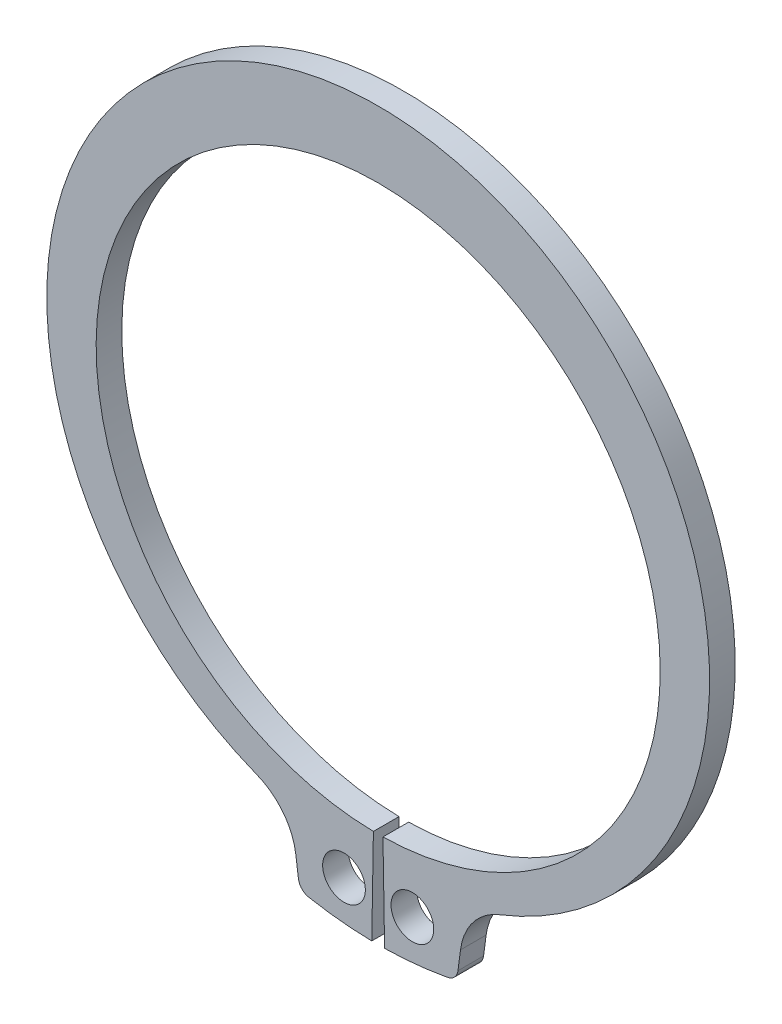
ISO-10303-21;
HEADER;
FILE_DESCRIPTION(('STEP AP214'),'2;1');
FILE_NAME('part.step','',(''),(''),'','','');
FILE_SCHEMA(('AUTOMOTIVE_DESIGN { 1 0 10303 214 1 1 1 1 }'));
ENDSEC;
DATA;
#1=APPLICATION_CONTEXT('core data for automotive mechanical design processes');
#2=APPLICATION_PROTOCOL_DEFINITION('international standard','automotive_design',2000,#1);
#3=PRODUCT_CONTEXT('',#1,'mechanical');
#4=PRODUCT('Part','Part','',(#3));
#5=PRODUCT_RELATED_PRODUCT_CATEGORY('part','',(#4));
#6=PRODUCT_DEFINITION_FORMATION('','',#4);
#7=PRODUCT_DEFINITION_CONTEXT('part definition',#1,'design');
#8=PRODUCT_DEFINITION('design','',#6,#7);
#9=PRODUCT_DEFINITION_SHAPE('','',#8);
#10=(LENGTH_UNIT() NAMED_UNIT(*) SI_UNIT(.MILLI.,.METRE.));
#11=(NAMED_UNIT(*) PLANE_ANGLE_UNIT() SI_UNIT($,.RADIAN.));
#12=(NAMED_UNIT(*) SI_UNIT($,.STERADIAN.) SOLID_ANGLE_UNIT());
#13=UNCERTAINTY_MEASURE_WITH_UNIT(LENGTH_MEASURE(1.E-05),#10,'distance_accuracy_value','');
#14=(GEOMETRIC_REPRESENTATION_CONTEXT(3) GLOBAL_UNCERTAINTY_ASSIGNED_CONTEXT((#13)) GLOBAL_UNIT_ASSIGNED_CONTEXT((#10,
#11,#12)) REPRESENTATION_CONTEXT('',''));
#15=CARTESIAN_POINT('',(0.,0.,0.));
#16=DIRECTION('',(0.,0.,1.));
#17=DIRECTION('',(1.,0.,0.));
#18=AXIS2_PLACEMENT_3D('',#15,#16,#17);
#19=CARTESIAN_POINT('',(0.,0.,-1.5));
#20=DIRECTION('',(0.,0.,1.));
#21=DIRECTION('',(1.,0.,0.));
#22=AXIS2_PLACEMENT_3D('',#19,#20,#21);
#23=CYLINDRICAL_SURFACE('',#22,16.5);
#24=CARTESIAN_POINT('',(0.,0.,0.));
#25=DIRECTION('',(0.,0.,-1.));
#26=DIRECTION('',(1.,0.,0.));
#27=AXIS2_PLACEMENT_3D('',#24,#25,#26);
#28=CIRCLE('',#27,16.5);
#29=CARTESIAN_POINT('',(-0.279977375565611,-16.4976244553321,0.));
#30=VERTEX_POINT('',#29);
#31=CARTESIAN_POINT('',(0.279977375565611,-16.4976244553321,0.));
#32=VERTEX_POINT('',#31);
#33=EDGE_CURVE('E120',#30,#32,#28,.T.);
#34=ORIENTED_EDGE('',*,*,#33,.F.);
#35=DIRECTION('',(0.,0.,1.));
#36=VECTOR('',#35,1.);
#37=CARTESIAN_POINT('',(-0.279977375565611,-16.4976244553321,-1.5));
#38=LINE('',#37,#36);
#39=CARTESIAN_POINT('',(-0.279977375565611,-16.4976244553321,-1.5));
#40=VERTEX_POINT('',#39);
#41=EDGE_CURVE('E11',#40,#30,#38,.T.);
#42=ORIENTED_EDGE('',*,*,#41,.F.);
#43=CARTESIAN_POINT('',(0.,0.,-1.5));
#44=DIRECTION('',(0.,0.,-1.));
#45=DIRECTION('',(1.,0.,0.));
#46=AXIS2_PLACEMENT_3D('',#43,#44,#45);
#47=CIRCLE('',#46,16.5);
#48=CARTESIAN_POINT('',(0.279977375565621,-16.4976244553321,-1.5));
#49=VERTEX_POINT('',#48);
#50=EDGE_CURVE('E122',#40,#49,#47,.T.);
#51=ORIENTED_EDGE('',*,*,#50,.T.);
#52=DIRECTION('',(0.,0.,1.));
#53=VECTOR('',#52,1.);
#54=CARTESIAN_POINT('',(0.279977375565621,-16.4976244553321,-1.5));
#55=LINE('',#54,#53);
#56=EDGE_CURVE('E35',#49,#32,#55,.T.);
#57=ORIENTED_EDGE('',*,*,#56,.T.);
#58=EDGE_LOOP('',(#34,#42,#51,#57));
#59=FACE_BOUND('',#58,.T.);
#60=ADVANCED_FACE('F32',(#59),#23,.F.);
#61=CARTESIAN_POINT('',(-0.279977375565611,-16.4976244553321,-1.5));
#62=DIRECTION('',(0.999856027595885,-0.0169683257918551,0.));
#63=DIRECTION('',(0.0169683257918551,0.999856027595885,0.));
#64=AXIS2_PLACEMENT_3D('',#61,#62,#63);
#65=PLANE('',#64);
#66=DIRECTION('',(0.0169683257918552,0.999856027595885,0.));
#67=VECTOR('',#66,1.);
#68=CARTESIAN_POINT('',(-0.279977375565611,-16.4976244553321,0.));
#69=LINE('',#68,#67);
#70=CARTESIAN_POINT('',(-0.375000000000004,-22.0968182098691,0.));
#71=VERTEX_POINT('',#70);
#72=EDGE_CURVE('E138',#71,#30,#69,.T.);
#73=ORIENTED_EDGE('',*,*,#72,.F.);
#74=DIRECTION('',(0.,0.,1.));
#75=VECTOR('',#74,1.);
#76=CARTESIAN_POINT('',(-0.375,-22.0968182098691,-1.5));
#77=LINE('',#76,#75);
#78=CARTESIAN_POINT('',(-0.375,-22.0968182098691,-1.5));
#79=VERTEX_POINT('',#78);
#80=EDGE_CURVE('E40',#79,#71,#77,.T.);
#81=ORIENTED_EDGE('',*,*,#80,.F.);
#82=DIRECTION('',(0.0169683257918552,0.999856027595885,0.));
#83=VECTOR('',#82,1.);
#84=CARTESIAN_POINT('',(-0.279977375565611,-16.4976244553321,-1.5));
#85=LINE('',#84,#83);
#86=EDGE_CURVE('E127',#79,#40,#85,.T.);
#87=ORIENTED_EDGE('',*,*,#86,.T.);
#88=ORIENTED_EDGE('',*,*,#41,.T.);
#89=EDGE_LOOP('',(#73,#81,#87,#88));
#90=FACE_BOUND('',#89,.T.);
#91=ADVANCED_FACE('F250',(#90),#65,.T.);
#92=CARTESIAN_POINT('',(0.,0.,-1.5));
#93=DIRECTION('',(0.,0.,1.));
#94=DIRECTION('',(1.,0.,0.));
#95=AXIS2_PLACEMENT_3D('',#92,#93,#94);
#96=CYLINDRICAL_SURFACE('',#95,22.1);
#97=CARTESIAN_POINT('',(0.,0.,0.));
#98=DIRECTION('',(0.,0.,1.));
#99=DIRECTION('',(1.,0.,0.));
#100=AXIS2_PLACEMENT_3D('',#97,#98,#99);
#101=CIRCLE('',#100,22.1);
#102=CARTESIAN_POINT('',(-4.06106897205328,-21.7236672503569,0.));
#103=VERTEX_POINT('',#102);
#104=EDGE_CURVE('E168',#103,#71,#101,.T.);
#105=ORIENTED_EDGE('',*,*,#104,.F.);
#106=DIRECTION('',(0.,0.,1.));
#107=VECTOR('',#106,1.);
#108=CARTESIAN_POINT('',(-4.06106897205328,-21.7236672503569,-1.5));
#109=LINE('',#108,#107);
#110=CARTESIAN_POINT('',(-4.06106897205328,-21.7236672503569,-1.5));
#111=VERTEX_POINT('',#110);
#112=EDGE_CURVE('E202',#111,#103,#109,.T.);
#113=ORIENTED_EDGE('',*,*,#112,.F.);
#114=CARTESIAN_POINT('',(0.,0.,-1.5));
#115=DIRECTION('',(0.,0.,1.));
#116=DIRECTION('',(1.,0.,0.));
#117=AXIS2_PLACEMENT_3D('',#114,#115,#116);
#118=CIRCLE('',#117,22.1);
#119=EDGE_CURVE('E198',#111,#79,#118,.T.);
#120=ORIENTED_EDGE('',*,*,#119,.T.);
#121=ORIENTED_EDGE('',*,*,#80,.T.);
#122=EDGE_LOOP('',(#105,#113,#120,#121));
#123=FACE_BOUND('',#122,.T.);
#124=ADVANCED_FACE('F255',(#123),#96,.T.);
#125=CARTESIAN_POINT('',(-3.92324988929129,-20.986438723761,-1.5));
#126=DIRECTION('',(0.,0.,1.));
#127=DIRECTION('',(1.,0.,0.));
#128=AXIS2_PLACEMENT_3D('',#125,#126,#127);
#129=CYLINDRICAL_SURFACE('',#128,0.750000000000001);
#130=CARTESIAN_POINT('',(-3.92324988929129,-20.986438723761,0.));
#131=DIRECTION('',(0.,0.,1.));
#132=DIRECTION('',(1.,0.,0.));
#133=AXIS2_PLACEMENT_3D('',#130,#131,#132);
#134=CIRCLE('',#133,0.750000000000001);
#135=CARTESIAN_POINT('',(-4.66683353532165,-21.0843333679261,0.));
#136=VERTEX_POINT('',#135);
#137=EDGE_CURVE('E165',#136,#103,#134,.T.);
#138=ORIENTED_EDGE('',*,*,#137,.F.);
#139=DIRECTION('',(0.,0.,1.));
#140=VECTOR('',#139,1.);
#141=CARTESIAN_POINT('',(-4.66683353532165,-21.0843333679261,-1.5));
#142=LINE('',#141,#140);
#143=CARTESIAN_POINT('',(-4.66683353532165,-21.0843333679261,-1.5));
#144=VERTEX_POINT('',#143);
#145=EDGE_CURVE('E204',#144,#136,#142,.T.);
#146=ORIENTED_EDGE('',*,*,#145,.F.);
#147=CARTESIAN_POINT('',(-3.92324988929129,-20.986438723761,-1.5));
#148=DIRECTION('',(0.,0.,1.));
#149=DIRECTION('',(1.,0.,0.));
#150=AXIS2_PLACEMENT_3D('',#147,#148,#149);
#151=CIRCLE('',#150,0.750000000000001);
#152=EDGE_CURVE('E195',#144,#111,#151,.T.);
#153=ORIENTED_EDGE('',*,*,#152,.T.);
#154=ORIENTED_EDGE('',*,*,#112,.T.);
#155=EDGE_LOOP('',(#138,#146,#153,#154));
#156=FACE_BOUND('',#155,.T.);
#157=ADVANCED_FACE('F247',(#156),#129,.T.);
#158=CARTESIAN_POINT('',(-4.81604707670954,-19.9509439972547,-1.5));
#159=DIRECTION('',(-0.991444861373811,-0.130526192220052,0.));
#160=DIRECTION('',(0.130526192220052,-0.991444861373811,0.));
#161=AXIS2_PLACEMENT_3D('',#158,#159,#160);
#162=PLANE('',#161);
#163=DIRECTION('',(0.130526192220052,-0.991444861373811,0.));
#164=VECTOR('',#163,1.);
#165=CARTESIAN_POINT('',(-4.81604707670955,-19.9509439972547,0.));
#166=LINE('',#165,#164);
#167=CARTESIAN_POINT('',(-4.81604707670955,-19.9509439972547,0.));
#168=VERTEX_POINT('',#167);
#169=EDGE_CURVE('E162',#168,#136,#166,.T.);
#170=ORIENTED_EDGE('',*,*,#169,.F.);
#171=DIRECTION('',(0.,0.,1.));
#172=VECTOR('',#171,1.);
#173=CARTESIAN_POINT('',(-4.81604707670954,-19.9509439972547,-1.5));
#174=LINE('',#173,#172);
#175=CARTESIAN_POINT('',(-4.81604707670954,-19.9509439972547,-1.5));
#176=VERTEX_POINT('',#175);
#177=EDGE_CURVE('E206',#176,#168,#174,.T.);
#178=ORIENTED_EDGE('',*,*,#177,.F.);
#179=DIRECTION('',(0.130526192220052,-0.991444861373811,0.));
#180=VECTOR('',#179,1.);
#181=CARTESIAN_POINT('',(-4.81604707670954,-19.9509439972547,-1.5));
#182=LINE('',#181,#180);
#183=EDGE_CURVE('E192',#176,#144,#182,.T.);
#184=ORIENTED_EDGE('',*,*,#183,.T.);
#185=ORIENTED_EDGE('',*,*,#145,.T.);
#186=EDGE_LOOP('',(#170,#178,#184,#185));
#187=FACE_BOUND('',#186,.T.);
#188=ADVANCED_FACE('F243',(#187),#162,.T.);
#189=CARTESIAN_POINT('',(-8.43421730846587,-20.4272851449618,-1.5));
#190=DIRECTION('',(0.,0.,1.));
#191=DIRECTION('',(1.,0.,0.));
#192=AXIS2_PLACEMENT_3D('',#189,#190,#191);
#193=CYLINDRICAL_SURFACE('',#192,3.64939128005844);
#194=CARTESIAN_POINT('',(-8.43421730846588,-20.4272851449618,0.));
#195=DIRECTION('',(0.,0.,-1.));
#196=DIRECTION('',(1.,0.,0.));
#197=AXIS2_PLACEMENT_3D('',#194,#195,#196);
#198=CIRCLE('',#197,3.64939128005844);
#199=CARTESIAN_POINT('',(-7.09817652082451,-17.0312504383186,0.));
#200=VERTEX_POINT('',#199);
#201=EDGE_CURVE('E159',#200,#168,#198,.T.);
#202=ORIENTED_EDGE('',*,*,#201,.F.);
#203=DIRECTION('',(0.,0.,1.));
#204=VECTOR('',#203,1.);
#205=CARTESIAN_POINT('',(-7.09817652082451,-17.0312504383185,-1.5));
#206=LINE('',#205,#204);
#207=CARTESIAN_POINT('',(-7.09817652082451,-17.0312504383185,-1.5));
#208=VERTEX_POINT('',#207);
#209=EDGE_CURVE('E208',#208,#200,#206,.T.);
#210=ORIENTED_EDGE('',*,*,#209,.F.);
#211=CARTESIAN_POINT('',(-8.43421730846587,-20.4272851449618,-1.5));
#212=DIRECTION('',(0.,0.,-1.));
#213=DIRECTION('',(1.,0.,0.));
#214=AXIS2_PLACEMENT_3D('',#211,#212,#213);
#215=CIRCLE('',#214,3.64939128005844);
#216=EDGE_CURVE('E189',#208,#176,#215,.T.);
#217=ORIENTED_EDGE('',*,*,#216,.T.);
#218=ORIENTED_EDGE('',*,*,#177,.T.);
#219=EDGE_LOOP('',(#202,#210,#217,#218));
#220=FACE_BOUND('',#219,.T.);
#221=ADVANCED_FACE('F239',(#220),#193,.F.);
#222=CARTESIAN_POINT('',(0.,1.01135278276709,-1.5));
#223=DIRECTION('',(0.,0.,1.));
#224=DIRECTION('',(1.,0.,0.));
#225=AXIS2_PLACEMENT_3D('',#222,#223,#224);
#226=CYLINDRICAL_SURFACE('',#225,19.3886472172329);
#227=CARTESIAN_POINT('',(0.,1.01135278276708,0.));
#228=DIRECTION('',(0.,0.,1.));
#229=DIRECTION('',(1.,0.,0.));
#230=AXIS2_PLACEMENT_3D('',#227,#228,#229);
#231=CIRCLE('',#230,19.3886472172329);
#232=CARTESIAN_POINT('',(7.09817652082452,-17.0312504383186,0.));
#233=VERTEX_POINT('',#232);
#234=EDGE_CURVE('E156',#233,#200,#231,.T.);
#235=ORIENTED_EDGE('',*,*,#234,.F.);
#236=DIRECTION('',(0.,0.,1.));
#237=VECTOR('',#236,1.);
#238=CARTESIAN_POINT('',(7.09817652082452,-17.0312504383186,-1.5));
#239=LINE('',#238,#237);
#240=CARTESIAN_POINT('',(7.09817652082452,-17.0312504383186,-1.5));
#241=VERTEX_POINT('',#240);
#242=EDGE_CURVE('E210',#241,#233,#239,.T.);
#243=ORIENTED_EDGE('',*,*,#242,.F.);
#244=CARTESIAN_POINT('',(0.,1.01135278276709,-1.5));
#245=DIRECTION('',(0.,0.,1.));
#246=DIRECTION('',(1.,0.,0.));
#247=AXIS2_PLACEMENT_3D('',#244,#245,#246);
#248=CIRCLE('',#247,19.3886472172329);
#249=EDGE_CURVE('E186',#241,#208,#248,.T.);
#250=ORIENTED_EDGE('',*,*,#249,.T.);
#251=ORIENTED_EDGE('',*,*,#209,.T.);
#252=EDGE_LOOP('',(#235,#243,#250,#251));
#253=FACE_BOUND('',#252,.T.);
#254=ADVANCED_FACE('F235',(#253),#226,.T.);
#255=CARTESIAN_POINT('',(8.43421730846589,-20.4272851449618,-1.5));
#256=DIRECTION('',(0.,0.,1.));
#257=DIRECTION('',(1.,0.,0.));
#258=AXIS2_PLACEMENT_3D('',#255,#256,#257);
#259=CYLINDRICAL_SURFACE('',#258,3.64939128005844);
#260=CARTESIAN_POINT('',(8.43421730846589,-20.4272851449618,0.));
#261=DIRECTION('',(0.,0.,-1.));
#262=DIRECTION('',(1.,0.,0.));
#263=AXIS2_PLACEMENT_3D('',#260,#261,#262);
#264=CIRCLE('',#263,3.64939128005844);
#265=CARTESIAN_POINT('',(4.81604707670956,-19.9509439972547,0.));
#266=VERTEX_POINT('',#265);
#267=EDGE_CURVE('E153',#266,#233,#264,.T.);
#268=ORIENTED_EDGE('',*,*,#267,.F.);
#269=DIRECTION('',(0.,0.,1.));
#270=VECTOR('',#269,1.);
#271=CARTESIAN_POINT('',(4.81604707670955,-19.9509439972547,-1.5));
#272=LINE('',#271,#270);
#273=CARTESIAN_POINT('',(4.81604707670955,-19.9509439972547,-1.5));
#274=VERTEX_POINT('',#273);
#275=EDGE_CURVE('E212',#274,#266,#272,.T.);
#276=ORIENTED_EDGE('',*,*,#275,.F.);
#277=CARTESIAN_POINT('',(8.43421730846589,-20.4272851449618,-1.5));
#278=DIRECTION('',(0.,0.,-1.));
#279=DIRECTION('',(1.,0.,0.));
#280=AXIS2_PLACEMENT_3D('',#277,#278,#279);
#281=CIRCLE('',#280,3.64939128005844);
#282=EDGE_CURVE('E183',#274,#241,#281,.T.);
#283=ORIENTED_EDGE('',*,*,#282,.T.);
#284=ORIENTED_EDGE('',*,*,#242,.T.);
#285=EDGE_LOOP('',(#268,#276,#283,#284));
#286=FACE_BOUND('',#285,.T.);
#287=ADVANCED_FACE('F231',(#286),#259,.F.);
#288=CARTESIAN_POINT('',(4.81604707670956,-19.9509439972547,-1.5));
#289=DIRECTION('',(0.991444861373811,-0.130526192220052,0.));
#290=DIRECTION('',(0.130526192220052,0.991444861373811,0.));
#291=AXIS2_PLACEMENT_3D('',#288,#289,#290);
#292=PLANE('',#291);
#293=DIRECTION('',(0.130526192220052,0.991444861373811,0.));
#294=VECTOR('',#293,1.);
#295=CARTESIAN_POINT('',(4.81604707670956,-19.9509439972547,0.));
#296=LINE('',#295,#294);
#297=CARTESIAN_POINT('',(4.66683353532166,-21.0843333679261,0.));
#298=VERTEX_POINT('',#297);
#299=EDGE_CURVE('E150',#298,#266,#296,.T.);
#300=ORIENTED_EDGE('',*,*,#299,.F.);
#301=DIRECTION('',(0.,0.,1.));
#302=VECTOR('',#301,1.);
#303=CARTESIAN_POINT('',(4.66683353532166,-21.0843333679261,-1.5));
#304=LINE('',#303,#302);
#305=CARTESIAN_POINT('',(4.66683353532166,-21.0843333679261,-1.5));
#306=VERTEX_POINT('',#305);
#307=EDGE_CURVE('E214',#306,#298,#304,.T.);
#308=ORIENTED_EDGE('',*,*,#307,.F.);
#309=DIRECTION('',(0.130526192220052,0.991444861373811,0.));
#310=VECTOR('',#309,1.);
#311=CARTESIAN_POINT('',(4.81604707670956,-19.9509439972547,-1.5));
#312=LINE('',#311,#310);
#313=EDGE_CURVE('E180',#306,#274,#312,.T.);
#314=ORIENTED_EDGE('',*,*,#313,.T.);
#315=ORIENTED_EDGE('',*,*,#275,.T.);
#316=EDGE_LOOP('',(#300,#308,#314,#315));
#317=FACE_BOUND('',#316,.T.);
#318=ADVANCED_FACE('F227',(#317),#292,.T.);
#319=CARTESIAN_POINT('',(3.9232498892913,-20.986438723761,-1.5));
#320=DIRECTION('',(0.,0.,1.));
#321=DIRECTION('',(1.,0.,0.));
#322=AXIS2_PLACEMENT_3D('',#319,#320,#321);
#323=CYLINDRICAL_SURFACE('',#322,0.750000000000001);
#324=CARTESIAN_POINT('',(3.9232498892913,-20.986438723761,0.));
#325=DIRECTION('',(0.,0.,1.));
#326=DIRECTION('',(-1.,0.,0.));
#327=AXIS2_PLACEMENT_3D('',#324,#325,#326);
#328=CIRCLE('',#327,0.750000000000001);
#329=CARTESIAN_POINT('',(4.06106897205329,-21.7236672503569,0.));
#330=VERTEX_POINT('',#329);
#331=EDGE_CURVE('E147',#330,#298,#328,.T.);
#332=ORIENTED_EDGE('',*,*,#331,.F.);
#333=DIRECTION('',(0.,0.,1.));
#334=VECTOR('',#333,1.);
#335=CARTESIAN_POINT('',(4.06106897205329,-21.7236672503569,-1.5));
#336=LINE('',#335,#334);
#337=CARTESIAN_POINT('',(4.06106897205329,-21.7236672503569,-1.5));
#338=VERTEX_POINT('',#337);
#339=EDGE_CURVE('E216',#338,#330,#336,.T.);
#340=ORIENTED_EDGE('',*,*,#339,.F.);
#341=CARTESIAN_POINT('',(3.9232498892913,-20.986438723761,-1.5));
#342=DIRECTION('',(0.,0.,1.));
#343=DIRECTION('',(-1.,0.,0.));
#344=AXIS2_PLACEMENT_3D('',#341,#342,#343);
#345=CIRCLE('',#344,0.750000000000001);
#346=EDGE_CURVE('E177',#338,#306,#345,.T.);
#347=ORIENTED_EDGE('',*,*,#346,.T.);
#348=ORIENTED_EDGE('',*,*,#307,.T.);
#349=EDGE_LOOP('',(#332,#340,#347,#348));
#350=FACE_BOUND('',#349,.T.);
#351=ADVANCED_FACE('F223',(#350),#323,.T.);
#352=CARTESIAN_POINT('',(0.,0.,-1.5));
#353=DIRECTION('',(0.,0.,1.));
#354=DIRECTION('',(1.,0.,0.));
#355=AXIS2_PLACEMENT_3D('',#352,#353,#354);
#356=CYLINDRICAL_SURFACE('',#355,22.1);
#357=CARTESIAN_POINT('',(0.,0.,0.));
#358=DIRECTION('',(0.,0.,1.));
#359=DIRECTION('',(1.,0.,0.));
#360=AXIS2_PLACEMENT_3D('',#357,#358,#359);
#361=CIRCLE('',#360,22.1);
#362=CARTESIAN_POINT('',(0.375000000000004,-22.0968182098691,0.));
#363=VERTEX_POINT('',#362);
#364=EDGE_CURVE('E134',#363,#330,#361,.T.);
#365=ORIENTED_EDGE('',*,*,#364,.F.);
#366=DIRECTION('',(0.,0.,1.));
#367=VECTOR('',#366,1.);
#368=CARTESIAN_POINT('',(0.375000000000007,-22.0968182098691,-1.49999999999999));
#369=LINE('',#368,#367);
#370=CARTESIAN_POINT('',(0.375000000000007,-22.0968182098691,-1.49999999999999));
#371=VERTEX_POINT('',#370);
#372=EDGE_CURVE('E126',#371,#363,#369,.T.);
#373=ORIENTED_EDGE('',*,*,#372,.F.);
#374=CARTESIAN_POINT('',(0.,0.,-1.5));
#375=DIRECTION('',(0.,0.,1.));
#376=DIRECTION('',(1.,0.,0.));
#377=AXIS2_PLACEMENT_3D('',#374,#375,#376);
#378=CIRCLE('',#377,22.1);
#379=EDGE_CURVE('E174',#371,#338,#378,.T.);
#380=ORIENTED_EDGE('',*,*,#379,.T.);
#381=ORIENTED_EDGE('',*,*,#339,.T.);
#382=EDGE_LOOP('',(#365,#373,#380,#381));
#383=FACE_BOUND('',#382,.T.);
#384=ADVANCED_FACE('F219',(#383),#356,.T.);
#385=CARTESIAN_POINT('',(0.279977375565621,-16.4976244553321,-1.5));
#386=DIRECTION('',(-0.999856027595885,-0.0169683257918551,0.));
#387=DIRECTION('',(0.0169683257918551,-0.999856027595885,0.));
#388=AXIS2_PLACEMENT_3D('',#385,#386,#387);
#389=PLANE('',#388);
#390=DIRECTION('',(0.0169683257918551,-0.999856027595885,0.));
#391=VECTOR('',#390,1.);
#392=CARTESIAN_POINT('',(0.279977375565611,-16.4976244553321,0.));
#393=LINE('',#392,#391);
#394=EDGE_CURVE('E129',#32,#363,#393,.T.);
#395=ORIENTED_EDGE('',*,*,#394,.F.);
#396=ORIENTED_EDGE('',*,*,#56,.F.);
#397=DIRECTION('',(0.0169683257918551,-0.999856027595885,0.));
#398=VECTOR('',#397,1.);
#399=CARTESIAN_POINT('',(0.279977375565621,-16.4976244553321,-1.5));
#400=LINE('',#399,#398);
#401=EDGE_CURVE('E172',#49,#371,#400,.T.);
#402=ORIENTED_EDGE('',*,*,#401,.T.);
#403=ORIENTED_EDGE('',*,*,#372,.T.);
#404=EDGE_LOOP('',(#395,#396,#402,#403));
#405=FACE_BOUND('',#404,.T.);
#406=ADVANCED_FACE('F130',(#405),#389,.T.);
#407=CARTESIAN_POINT('',(0.,0.,-1.5));
#408=DIRECTION('',(0.,0.,1.));
#409=DIRECTION('',(1.,0.,0.));
#410=AXIS2_PLACEMENT_3D('',#407,#408,#409);
#411=PLANE('',#410);
#412=CARTESIAN_POINT('',(-2.,-19.69873092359,-1.49999999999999));
#413=DIRECTION('',(0.,0.,1.));
#414=DIRECTION('',(1.,0.,0.));
#415=AXIS2_PLACEMENT_3D('',#412,#413,#414);
#416=CIRCLE('',#415,1.25);
#417=CARTESIAN_POINT('',(-0.749999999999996,-19.69873092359,-1.49999999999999));
#418=VERTEX_POINT('',#417);
#419=EDGE_CURVE('E389',#418,#418,#416,.T.);
#420=ORIENTED_EDGE('',*,*,#419,.T.);
#421=EDGE_LOOP('',(#420));
#422=FACE_BOUND('',#421,.T.);
#423=CARTESIAN_POINT('',(2.,-19.69873092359,-1.5));
#424=DIRECTION('',(0.,0.,1.));
#425=DIRECTION('',(1.,0.,0.));
#426=AXIS2_PLACEMENT_3D('',#423,#424,#425);
#427=CIRCLE('',#426,1.25);
#428=CARTESIAN_POINT('',(3.25,-19.69873092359,-1.5));
#429=VERTEX_POINT('',#428);
#430=EDGE_CURVE('E139',#429,#429,#427,.T.);
#431=ORIENTED_EDGE('',*,*,#430,.T.);
#432=EDGE_LOOP('',(#431));
#433=FACE_BOUND('',#432,.T.);
#434=ORIENTED_EDGE('',*,*,#50,.F.);
#435=ORIENTED_EDGE('',*,*,#86,.F.);
#436=ORIENTED_EDGE('',*,*,#119,.F.);
#437=ORIENTED_EDGE('',*,*,#152,.F.);
#438=ORIENTED_EDGE('',*,*,#183,.F.);
#439=ORIENTED_EDGE('',*,*,#216,.F.);
#440=ORIENTED_EDGE('',*,*,#249,.F.);
#441=ORIENTED_EDGE('',*,*,#282,.F.);
#442=ORIENTED_EDGE('',*,*,#313,.F.);
#443=ORIENTED_EDGE('',*,*,#346,.F.);
#444=ORIENTED_EDGE('',*,*,#379,.F.);
#445=ORIENTED_EDGE('',*,*,#401,.F.);
#446=EDGE_LOOP('',(#434,#435,#436,#437,#438,#439,#440,#441,#442,#443,#444,#445));
#447=FACE_BOUND('',#446,.T.);
#448=ADVANCED_FACE('F254',(#422,#433,#447),#411,.F.);
#449=CARTESIAN_POINT('',(0.,0.,0.));
#450=DIRECTION('',(0.,0.,1.));
#451=DIRECTION('',(1.,0.,0.));
#452=AXIS2_PLACEMENT_3D('',#449,#450,#451);
#453=PLANE('',#452);
#454=CARTESIAN_POINT('',(-2.,-19.69873092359,0.));
#455=DIRECTION('',(0.,0.,1.));
#456=DIRECTION('',(1.,0.,0.));
#457=AXIS2_PLACEMENT_3D('',#454,#455,#456);
#458=CIRCLE('',#457,1.25);
#459=CARTESIAN_POINT('',(-0.749999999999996,-19.69873092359,0.));
#460=VERTEX_POINT('',#459);
#461=EDGE_CURVE('E392',#460,#460,#458,.T.);
#462=ORIENTED_EDGE('',*,*,#461,.F.);
#463=EDGE_LOOP('',(#462));
#464=FACE_BOUND('',#463,.T.);
#465=CARTESIAN_POINT('',(2.,-19.69873092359,0.));
#466=DIRECTION('',(0.,0.,1.));
#467=DIRECTION('',(1.,0.,0.));
#468=AXIS2_PLACEMENT_3D('',#465,#466,#467);
#469=CIRCLE('',#468,1.25);
#470=CARTESIAN_POINT('',(3.25,-19.69873092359,0.));
#471=VERTEX_POINT('',#470);
#472=EDGE_CURVE('E142',#471,#471,#469,.T.);
#473=ORIENTED_EDGE('',*,*,#472,.F.);
#474=EDGE_LOOP('',(#473));
#475=FACE_BOUND('',#474,.T.);
#476=ORIENTED_EDGE('',*,*,#33,.T.);
#477=ORIENTED_EDGE('',*,*,#394,.T.);
#478=ORIENTED_EDGE('',*,*,#364,.T.);
#479=ORIENTED_EDGE('',*,*,#331,.T.);
#480=ORIENTED_EDGE('',*,*,#299,.T.);
#481=ORIENTED_EDGE('',*,*,#267,.T.);
#482=ORIENTED_EDGE('',*,*,#234,.T.);
#483=ORIENTED_EDGE('',*,*,#201,.T.);
#484=ORIENTED_EDGE('',*,*,#169,.T.);
#485=ORIENTED_EDGE('',*,*,#137,.T.);
#486=ORIENTED_EDGE('',*,*,#104,.T.);
#487=ORIENTED_EDGE('',*,*,#72,.T.);
#488=EDGE_LOOP('',(#476,#477,#478,#479,#480,#481,#482,#483,#484,#485,#486,#487));
#489=FACE_BOUND('',#488,.T.);
#490=ADVANCED_FACE('F136',(#464,#475,#489),#453,.T.);
#491=CARTESIAN_POINT('',(2.,-19.69873092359,-1.5));
#492=DIRECTION('',(0.,0.,1.));
#493=DIRECTION('',(1.,0.,0.));
#494=AXIS2_PLACEMENT_3D('',#491,#492,#493);
#495=CYLINDRICAL_SURFACE('',#494,1.25);
#496=ORIENTED_EDGE('',*,*,#430,.F.);
#497=EDGE_LOOP('',(#496));
#498=FACE_BOUND('',#497,.T.);
#499=ORIENTED_EDGE('',*,*,#472,.T.);
#500=EDGE_LOOP('',(#499));
#501=FACE_BOUND('',#500,.T.);
#502=ADVANCED_FACE('F362',(#498,#501),#495,.F.);
#503=CARTESIAN_POINT('',(-2.,-19.69873092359,-1.49999999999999));
#504=DIRECTION('',(0.,0.,1.));
#505=DIRECTION('',(1.,0.,0.));
#506=AXIS2_PLACEMENT_3D('',#503,#504,#505);
#507=CYLINDRICAL_SURFACE('',#506,1.25);
#508=ORIENTED_EDGE('',*,*,#419,.F.);
#509=EDGE_LOOP('',(#508));
#510=FACE_BOUND('',#509,.T.);
#511=ORIENTED_EDGE('',*,*,#461,.T.);
#512=EDGE_LOOP('',(#511));
#513=FACE_BOUND('',#512,.T.);
#514=ADVANCED_FACE('F372',(#510,#513),#507,.F.);
#515=CLOSED_SHELL('',(#60,#91,#124,#157,#188,#221,#254,#287,#318,#351,#384,#406,#448,#490,#502,#514));
#516=MANIFOLD_SOLID_BREP('B2',#515);
#517=ADVANCED_BREP_SHAPE_REPRESENTATION('',(#18,#516),#14);
#518=SHAPE_DEFINITION_REPRESENTATION(#9,#517);
ENDSEC;
END-ISO-10303-21;
